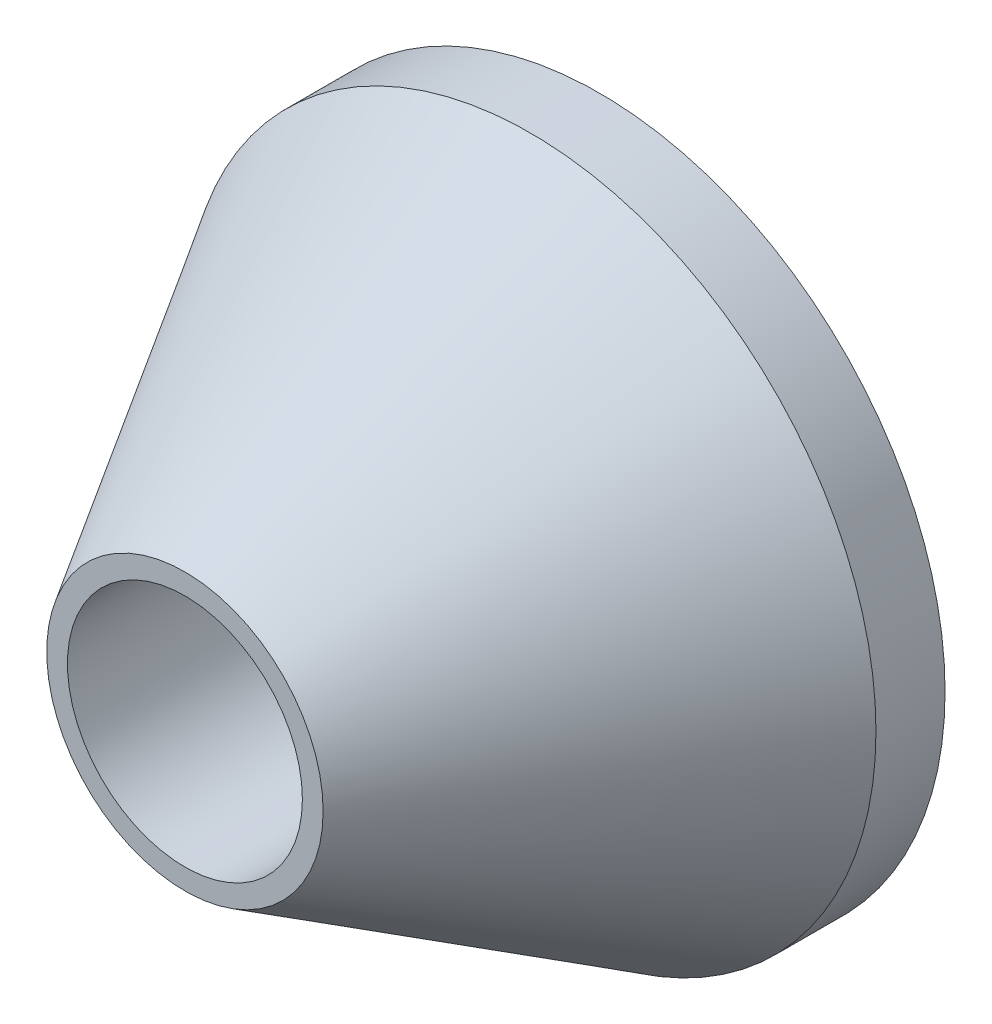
from build123d import *

# Parameters (mm, degrees)
ESQUISSE1_R      = 2.5
ESQUISSE1_R_2    = 0.85
EXTRUSION1_DEPTH = 3
CHANFREIN1_SIZE  = 2.5
CHANFREIN1_SIZE2 = 1.5


with BuildPart() as part:
    # Esquisse1 → Extrusion1 (new body)
    with BuildSketch(Plane.XY):
        Circle(ESQUISSE1_R)
        Circle(ESQUISSE1_R_2, mode=Mode.SUBTRACT)
    extrude(amount=EXTRUSION1_DEPTH)

    # Chanfrein1
    chanfrein1_edges = [part.edges().sort_by_distance(p)[0] for p in [
        (-2.5, 0, 3),
    ]]
    chanfrein1_side = [part.faces().sort_by_distance(p)[0] for p in [
        (-2.5, 0, 1.5),
    ]]
    chamfer(chanfrein1_edges, length=CHANFREIN1_SIZE, length2=CHANFREIN1_SIZE2, reference=chanfrein1_side[0])


solid = part.part
